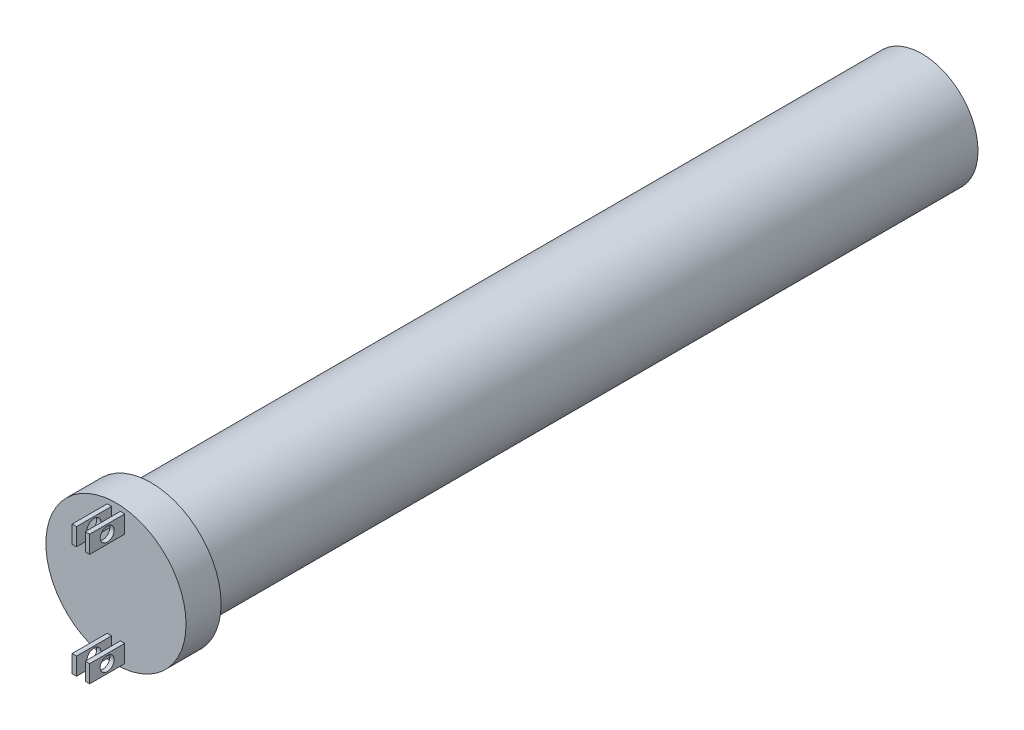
from build123d import *

# Parameters (mm, degrees)
SKETCH1_R           = 20.32
BOSS_EXTRUDE1_DEPTH = 279.4
SKETCH2_R           = 25.4
BOSS_EXTRUDE2_DEPTH = 12.7
SKETCH3_W           = 6.35
SKETCH3_H           = 6.35
BOSS_EXTRUDE3_DEPTH = 12.7
SKETCH4_R           = 2.54
CUT_EXTRUDE1_DEPTH  = 6.35
CUT_EXTRUDE2_START  = -1.5875
SKETCH5_W           = 12.7
SKETCH5_H           = 6.35
CUT_EXTRUDE2_DEPTH  = 3.175


with BuildPart() as part:
    # Sketch1 → Boss-Extrude1 (new body)
    with BuildSketch(Plane.XY):
        Circle(SKETCH1_R)
    extrude(amount=BOSS_EXTRUDE1_DEPTH)

    # Sketch2 → Boss-Extrude2 (add)
    with BuildSketch(Plane.XY.offset(279.4)):
        Circle(SKETCH2_R)
    extrude(amount=BOSS_EXTRUDE2_DEPTH)

    # Sketch3 → Boss-Extrude3 (add)
    with BuildSketch(Plane.XY.offset(292.1)):
        with Locations((0, 20.32)):
            Rectangle(SKETCH3_W, SKETCH3_H)
        with Locations((0, -20.32)):
            Rectangle(SKETCH3_W, SKETCH3_H)
    extrude(amount=BOSS_EXTRUDE3_DEPTH)

    # Sketch4 → Cut-Extrude1 (cut)
    with BuildSketch(Plane.ZY.offset(3.175)):
        with Locations((298.45, -20.32)):
            Circle(SKETCH4_R)
        with Locations((298.45, 20.32)):
            Circle(SKETCH4_R)
    extrude(amount=-CUT_EXTRUDE1_DEPTH, mode=Mode.SUBTRACT)

    # Sketch5 → Cut-Extrude2 (cut)
    with BuildSketch(Plane(origin=(3.175, 0, 0), x_dir=(0, 0, -1), z_dir=(1, 0, 0)).offset(CUT_EXTRUDE2_START)):
        with Locations((-298.45, -20.32)):
            Rectangle(SKETCH5_W, SKETCH5_H)
    cut_extrude2 = extrude(amount=-CUT_EXTRUDE2_DEPTH, mode=Mode.SUBTRACT)

    # Mirror1: Cut-Extrude2 across plane
    add(cut_extrude2.mirror(Plane.ZX), mode=Mode.SUBTRACT)


solid = part.part
